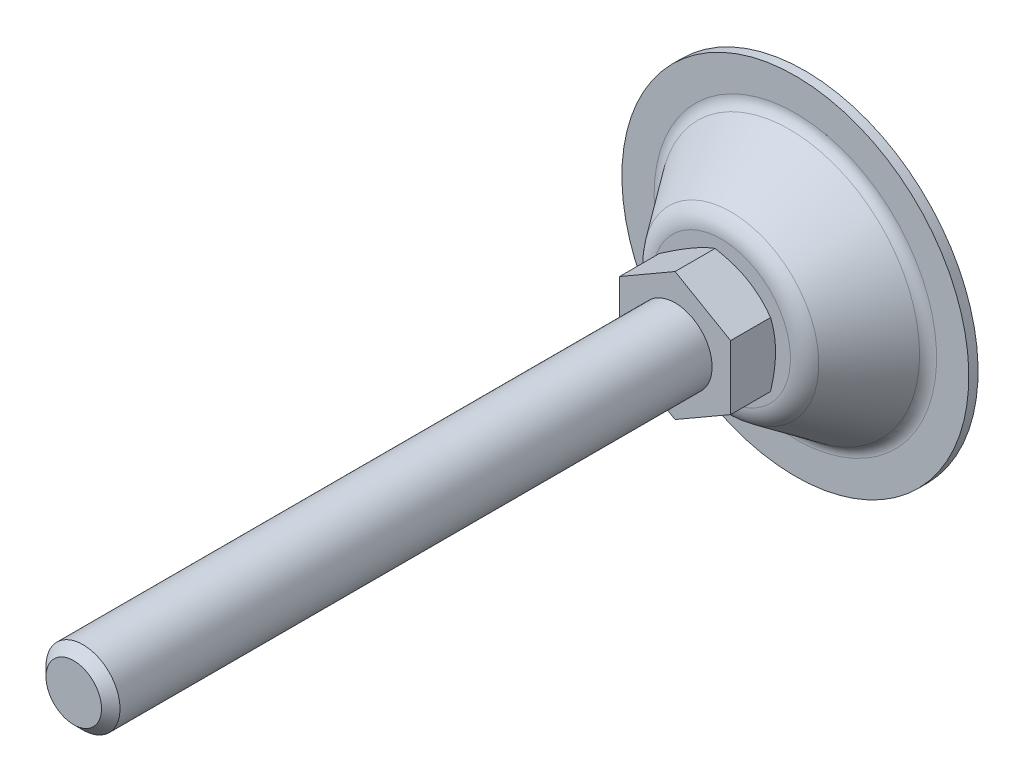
ISO-10303-21;
HEADER;
FILE_DESCRIPTION(('STEP AP214'),'2;1');
FILE_NAME('part.step','',(''),(''),'','','');
FILE_SCHEMA(('AUTOMOTIVE_DESIGN { 1 0 10303 214 1 1 1 1 }'));
ENDSEC;
DATA;
#1=APPLICATION_CONTEXT('core data for automotive mechanical design processes');
#2=APPLICATION_PROTOCOL_DEFINITION('international standard','automotive_design',2000,#1);
#3=PRODUCT_CONTEXT('',#1,'mechanical');
#4=PRODUCT('Part','Part','',(#3));
#5=PRODUCT_RELATED_PRODUCT_CATEGORY('part','',(#4));
#6=PRODUCT_DEFINITION_FORMATION('','',#4);
#7=PRODUCT_DEFINITION_CONTEXT('part definition',#1,'design');
#8=PRODUCT_DEFINITION('design','',#6,#7);
#9=PRODUCT_DEFINITION_SHAPE('','',#8);
#10=(LENGTH_UNIT() NAMED_UNIT(*) SI_UNIT(.MILLI.,.METRE.));
#11=(NAMED_UNIT(*) PLANE_ANGLE_UNIT() SI_UNIT($,.RADIAN.));
#12=(NAMED_UNIT(*) SI_UNIT($,.STERADIAN.) SOLID_ANGLE_UNIT());
#13=UNCERTAINTY_MEASURE_WITH_UNIT(LENGTH_MEASURE(1.E-05),#10,'distance_accuracy_value','');
#14=(GEOMETRIC_REPRESENTATION_CONTEXT(3) GLOBAL_UNCERTAINTY_ASSIGNED_CONTEXT((#13)) GLOBAL_UNIT_ASSIGNED_CONTEXT((#10,
#11,#12)) REPRESENTATION_CONTEXT('',''));
#15=CARTESIAN_POINT('',(0.,0.,0.));
#16=DIRECTION('',(0.,0.,1.));
#17=DIRECTION('',(1.,0.,0.));
#18=AXIS2_PLACEMENT_3D('',#15,#16,#17);
#19=CARTESIAN_POINT('',(0.,0.,28.));
#20=DIRECTION('',(0.,0.,1.));
#21=DIRECTION('',(0.5,-0.866025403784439,0.));
#22=AXIS2_PLACEMENT_3D('',#19,#20,#21);
#23=PLANE('',#22);
#24=DIRECTION('',(0.,1.,0.));
#25=VECTOR('',#24,1.);
#26=CARTESIAN_POINT('',(12.,-6.92820323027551,28.));
#27=LINE('',#26,#25);
#28=CARTESIAN_POINT('',(12.,-6.92820323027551,28.));
#29=VERTEX_POINT('',#28);
#30=CARTESIAN_POINT('',(12.,6.9282032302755,28.));
#31=VERTEX_POINT('',#30);
#32=EDGE_CURVE('E220',#29,#31,#27,.T.);
#33=ORIENTED_EDGE('',*,*,#32,.T.);
#34=DIRECTION('',(-0.866025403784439,0.5,0.));
#35=VECTOR('',#34,1.);
#36=CARTESIAN_POINT('',(12.,6.9282032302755,28.));
#37=LINE('',#36,#35);
#38=CARTESIAN_POINT('',(0.,13.856406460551,28.));
#39=VERTEX_POINT('',#38);
#40=EDGE_CURVE('E361',#31,#39,#37,.T.);
#41=ORIENTED_EDGE('',*,*,#40,.T.);
#42=DIRECTION('',(-0.866025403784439,-0.5,0.));
#43=VECTOR('',#42,1.);
#44=CARTESIAN_POINT('',(0.,13.856406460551,28.));
#45=LINE('',#44,#43);
#46=CARTESIAN_POINT('',(-12.,6.92820323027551,28.));
#47=VERTEX_POINT('',#46);
#48=EDGE_CURVE('E360',#39,#47,#45,.T.);
#49=ORIENTED_EDGE('',*,*,#48,.T.);
#50=DIRECTION('',(0.,-1.,0.));
#51=VECTOR('',#50,1.);
#52=CARTESIAN_POINT('',(-12.,6.92820323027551,28.));
#53=LINE('',#52,#51);
#54=CARTESIAN_POINT('',(-12.,-6.9282032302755,28.));
#55=VERTEX_POINT('',#54);
#56=EDGE_CURVE('E365',#47,#55,#53,.T.);
#57=ORIENTED_EDGE('',*,*,#56,.T.);
#58=DIRECTION('',(0.866025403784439,-0.5,0.));
#59=VECTOR('',#58,1.);
#60=CARTESIAN_POINT('',(-12.,-6.9282032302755,28.));
#61=LINE('',#60,#59);
#62=CARTESIAN_POINT('',(0.,-13.856406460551,28.));
#63=VERTEX_POINT('',#62);
#64=EDGE_CURVE('E367',#55,#63,#61,.T.);
#65=ORIENTED_EDGE('',*,*,#64,.T.);
#66=DIRECTION('',(0.866025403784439,0.5,0.));
#67=VECTOR('',#66,1.);
#68=CARTESIAN_POINT('',(0.,-13.856406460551,28.));
#69=LINE('',#68,#67);
#70=EDGE_CURVE('E37',#63,#29,#69,.T.);
#71=ORIENTED_EDGE('',*,*,#70,.T.);
#72=EDGE_LOOP('',(#33,#41,#49,#57,#65,#71));
#73=FACE_BOUND('',#72,.T.);
#74=CARTESIAN_POINT('',(0.,0.,28.));
#75=DIRECTION('',(0.,0.,1.));
#76=DIRECTION('',(0.5,-0.866025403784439,0.));
#77=AXIS2_PLACEMENT_3D('',#74,#75,#76);
#78=CIRCLE('',#77,8.);
#79=CARTESIAN_POINT('',(4.,-6.92820323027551,28.));
#80=VERTEX_POINT('',#79);
#81=EDGE_CURVE('E224',#80,#80,#78,.T.);
#82=ORIENTED_EDGE('',*,*,#81,.F.);
#83=EDGE_LOOP('',(#82));
#84=FACE_BOUND('',#83,.T.);
#85=ADVANCED_FACE('F14',(#73,#84),#23,.T.);
#86=CARTESIAN_POINT('',(-7.46811554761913,12.9351555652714,18.));
#87=DIRECTION('',(0.,0.,-1.));
#88=DIRECTION('',(-0.5,0.866025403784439,0.));
#89=AXIS2_PLACEMENT_3D('',#86,#87,#88);
#90=PLANE('',#89);
#91=CARTESIAN_POINT('',(-1.37317446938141E-13,2.37840794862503E-13,18.));
#92=DIRECTION('',(0.,0.,1.));
#93=DIRECTION('',(0.5,-0.866025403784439,0.));
#94=AXIS2_PLACEMENT_3D('',#91,#92,#93);
#95=CIRCLE('',#94,14.936231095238);
#96=CARTESIAN_POINT('',(7.46811554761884,-12.9351555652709,18.));
#97=VERTEX_POINT('',#96);
#98=EDGE_CURVE('E111',#97,#97,#95,.T.);
#99=ORIENTED_EDGE('',*,*,#98,.T.);
#100=EDGE_LOOP('',(#99));
#101=FACE_BOUND('',#100,.T.);
#102=CARTESIAN_POINT('',(0.,0.,18.));
#103=DIRECTION('',(0.,0.,-1.));
#104=DIRECTION('',(-0.5,0.866025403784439,0.));
#105=AXIS2_PLACEMENT_3D('',#102,#103,#104);
#106=CIRCLE('',#105,11.5);
#107=CARTESIAN_POINT('',(-5.75,9.95929214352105,18.));
#108=VERTEX_POINT('',#107);
#109=EDGE_CURVE('E84',#108,#108,#106,.T.);
#110=ORIENTED_EDGE('',*,*,#109,.T.);
#111=EDGE_LOOP('',(#110));
#112=FACE_BOUND('',#111,.T.);
#113=ADVANCED_FACE('F195',(#101,#112),#90,.F.);
#114=CARTESIAN_POINT('',(-1.54390389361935E-13,2.67411998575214E-13,4.9999999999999));
#115=DIRECTION('',(0.,0.,1.));
#116=DIRECTION('',(0.5,-0.866025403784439,0.));
#117=AXIS2_PLACEMENT_3D('',#114,#115,#116);
#118=TOROIDAL_SURFACE('',#117,30.5382613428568,3.);
#119=CARTESIAN_POINT('',(-1.55741344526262E-13,2.69751921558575E-13,3.24909185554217));
#120=DIRECTION('',(0.,0.,1.));
#121=DIRECTION('',(0.5,-0.866025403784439,0.));
#122=AXIS2_PLACEMENT_3D('',#119,#120,#121);
#123=CIRCLE('',#122,28.1022152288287);
#124=CARTESIAN_POINT('',(14.0511076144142,-24.3372322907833,3.2490918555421));
#125=VERTEX_POINT('',#124);
#126=EDGE_CURVE('E73',#125,#125,#123,.T.);
#127=ORIENTED_EDGE('',*,*,#126,.F.);
#128=EDGE_LOOP('',(#127));
#129=FACE_BOUND('',#128,.T.);
#130=CARTESIAN_POINT('',(-1.57301461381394E-13,2.72454123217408E-13,1.99999999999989));
#131=DIRECTION('',(0.,0.,1.));
#132=DIRECTION('',(0.5,-0.866025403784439,0.));
#133=AXIS2_PLACEMENT_3D('',#130,#131,#132);
#134=CIRCLE('',#133,30.5382613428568);
#135=CARTESIAN_POINT('',(15.2691306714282,-26.446910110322,1.99999999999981));
#136=VERTEX_POINT('',#135);
#137=EDGE_CURVE('E102',#136,#136,#134,.T.);
#138=ORIENTED_EDGE('',*,*,#137,.T.);
#139=EDGE_LOOP('',(#138));
#140=FACE_BOUND('',#139,.T.);
#141=ADVANCED_FACE('F198',(#129,#140),#118,.F.);
#142=CARTESIAN_POINT('',(-1.55741344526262E-13,2.69751921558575E-13,3.24909185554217));
#143=DIRECTION('',(0.,0.,-1.));
#144=DIRECTION('',(-0.5,0.866025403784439,0.));
#145=AXIS2_PLACEMENT_3D('',#142,#143,#144);
#146=CONICAL_SURFACE('',#145,28.1022152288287,0.623199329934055);
#147=CARTESIAN_POINT('',(-1.39917641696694E-13,2.42344464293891E-13,15.9181802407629));
#148=DIRECTION('',(0.,0.,1.));
#149=DIRECTION('',(0.5,-0.866025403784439,0.));
#150=AXIS2_PLACEMENT_3D('',#147,#148,#149);
#151=CIRCLE('',#150,18.9963079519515);
#152=CARTESIAN_POINT('',(9.49815397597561,-16.4512852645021,15.9181802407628));
#153=VERTEX_POINT('',#152);
#154=EDGE_CURVE('E114',#153,#153,#151,.T.);
#155=ORIENTED_EDGE('',*,*,#154,.F.);
#156=EDGE_LOOP('',(#155));
#157=FACE_BOUND('',#156,.T.);
#158=ORIENTED_EDGE('',*,*,#126,.T.);
#159=EDGE_LOOP('',(#158));
#160=FACE_BOUND('',#159,.T.);
#161=ADVANCED_FACE('F202',(#157,#160),#146,.T.);
#162=CARTESIAN_POINT('',(-1.43982048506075E-13,2.49384223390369E-13,13.));
#163=DIRECTION('',(0.,0.,1.));
#164=DIRECTION('',(0.5,-0.866025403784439,0.));
#165=AXIS2_PLACEMENT_3D('',#162,#163,#164);
#166=TOROIDAL_SURFACE('',#165,14.9362310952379,5.);
#167=ORIENTED_EDGE('',*,*,#98,.F.);
#168=EDGE_LOOP('',(#167));
#169=FACE_BOUND('',#168,.T.);
#170=ORIENTED_EDGE('',*,*,#154,.T.);
#171=EDGE_LOOP('',(#170));
#172=FACE_BOUND('',#171,.T.);
#173=ADVANCED_FACE('F193',(#169,#172),#166,.T.);
#174=CARTESIAN_POINT('',(-18.75,32.4759526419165,0.));
#175=DIRECTION('',(0.,0.,1.));
#176=DIRECTION('',(0.5,-0.866025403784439,0.));
#177=AXIS2_PLACEMENT_3D('',#174,#175,#176);
#178=PLANE('',#177);
#179=CARTESIAN_POINT('',(-1.59799463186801E-13,2.76780789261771E-13,-1.38777878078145E-13));
#180=DIRECTION('',(0.,0.,1.));
#181=DIRECTION('',(0.5,-0.866025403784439,0.));
#182=AXIS2_PLACEMENT_3D('',#179,#180,#181);
#183=CIRCLE('',#182,37.5);
#184=CARTESIAN_POINT('',(18.7499999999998,-32.4759526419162,-2.32452945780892E-13));
#185=VERTEX_POINT('',#184);
#186=EDGE_CURVE('E108',#185,#185,#183,.T.);
#187=ORIENTED_EDGE('',*,*,#186,.F.);
#188=EDGE_LOOP('',(#187));
#189=FACE_BOUND('',#188,.T.);
#190=ADVANCED_FACE('F189',(#189),#178,.F.);
#191=CARTESIAN_POINT('',(0.,0.,129.670029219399));
#192=DIRECTION('',(0.,0.,1.));
#193=DIRECTION('',(0.5,-0.866025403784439,0.));
#194=AXIS2_PLACEMENT_3D('',#191,#192,#193);
#195=CYLINDRICAL_SURFACE('',#194,37.5);
#196=CARTESIAN_POINT('',(-1.57301461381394E-13,2.72454123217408E-13,1.99999999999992));
#197=DIRECTION('',(0.,0.,1.));
#198=DIRECTION('',(0.5,-0.866025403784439,0.));
#199=AXIS2_PLACEMENT_3D('',#196,#197,#198);
#200=CIRCLE('',#199,37.5);
#201=CARTESIAN_POINT('',(18.7499999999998,-32.4759526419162,1.99999999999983));
#202=VERTEX_POINT('',#201);
#203=EDGE_CURVE('E105',#202,#202,#200,.T.);
#204=ORIENTED_EDGE('',*,*,#203,.F.);
#205=EDGE_LOOP('',(#204));
#206=FACE_BOUND('',#205,.T.);
#207=ORIENTED_EDGE('',*,*,#186,.T.);
#208=EDGE_LOOP('',(#207));
#209=FACE_BOUND('',#208,.T.);
#210=ADVANCED_FACE('F185',(#206,#209),#195,.T.);
#211=CARTESIAN_POINT('',(-18.75,32.4759526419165,2.));
#212=DIRECTION('',(0.,0.,-1.));
#213=DIRECTION('',(-0.5,0.866025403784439,0.));
#214=AXIS2_PLACEMENT_3D('',#211,#212,#213);
#215=PLANE('',#214);
#216=ORIENTED_EDGE('',*,*,#137,.F.);
#217=EDGE_LOOP('',(#216));
#218=FACE_BOUND('',#217,.T.);
#219=ORIENTED_EDGE('',*,*,#203,.T.);
#220=EDGE_LOOP('',(#219));
#221=FACE_BOUND('',#220,.T.);
#222=ADVANCED_FACE('F130',(#218,#221),#215,.F.);
#223=CARTESIAN_POINT('',(0.,0.,23.6283876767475));
#224=DIRECTION('',(0.,0.,1.));
#225=DIRECTION('',(0.5,-0.866025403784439,0.));
#226=AXIS2_PLACEMENT_3D('',#223,#224,#225);
#227=CONICAL_SURFACE('',#226,21.2486534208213,1.0471975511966);
#228=ORIENTED_EDGE('',*,*,#109,.F.);
#229=EDGE_LOOP('',(#228));
#230=FACE_BOUND('',#229,.T.);
#231=CARTESIAN_POINT('',(-10.0532557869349,-19.6606563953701,24.1094504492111));
#232=CARTESIAN_POINT('',(-9.82653838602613,-19.5297610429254,23.9825738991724));
#233=CARTESIAN_POINT('',(-9.59955317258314,-19.398711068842,23.856335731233));
#234=CARTESIAN_POINT('',(-9.14499119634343,-19.1362695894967,23.6052809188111));
#235=CARTESIAN_POINT('',(-8.91741442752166,-19.0048780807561,23.4804642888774));
#236=CARTESIAN_POINT('',(-8.23365135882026,-18.6101072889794,23.1083304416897));
#237=CARTESIAN_POINT('',(-7.77650041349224,-18.346171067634,22.8633674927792));
#238=CARTESIAN_POINT('',(-6.85659953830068,-17.8150660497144,22.3798814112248));
#239=CARTESIAN_POINT('',(-6.39383263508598,-17.5478874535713,22.1414012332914));
#240=CARTESIAN_POINT('',(-5.46459534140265,-17.0113920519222,21.6742979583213));
#241=CARTESIAN_POINT('',(-4.9981251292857,-16.7420753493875,21.4456743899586));
#242=CARTESIAN_POINT('',(-4.04609504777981,-16.1924205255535,20.9939474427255));
#243=CARTESIAN_POINT('',(-3.56039382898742,-15.912000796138,20.7712391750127));
#244=CARTESIAN_POINT('',(-2.58328268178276,-15.3478654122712,20.3428555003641));
#245=CARTESIAN_POINT('',(-2.09187211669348,-15.0641493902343,20.137182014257));
#246=CARTESIAN_POINT('',(-1.10351639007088,-14.4935219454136,19.7483225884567));
#247=CARTESIAN_POINT('',(-0.606584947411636,-14.2066184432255,19.565090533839));
#248=CARTESIAN_POINT('',(0.394451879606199,-13.628669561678,19.2270309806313));
#249=CARTESIAN_POINT('',(0.898554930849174,-13.3376255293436,19.072194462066));
#250=CARTESIAN_POINT('',(1.65882416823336,-12.8986838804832,18.8672836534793));
#251=CARTESIAN_POINT('',(1.91226998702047,-12.7523568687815,18.8036673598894));
#252=CARTESIAN_POINT('',(2.42088138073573,-12.4587099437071,18.6863216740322));
#253=CARTESIAN_POINT('',(2.6760469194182,-12.3113900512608,18.6325920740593));
#254=CARTESIAN_POINT('',(3.18791661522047,-12.0158619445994,18.5359727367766));
#255=CARTESIAN_POINT('',(3.44462075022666,-11.8676537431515,18.4930828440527));
#256=CARTESIAN_POINT('',(3.95929088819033,-11.5705088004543,18.4190010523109));
#257=CARTESIAN_POINT('',(4.2172568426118,-11.4215720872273,18.3878087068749));
#258=CARTESIAN_POINT('',(4.73074751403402,-11.1251081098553,18.3381289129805));
#259=CARTESIAN_POINT('',(4.98626060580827,-10.977587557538,18.319482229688));
#260=CARTESIAN_POINT('',(5.49773994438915,-10.6822848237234,18.294677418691));
#261=CARTESIAN_POINT('',(5.75370618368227,-10.534502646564,18.2885190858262));
#262=CARTESIAN_POINT('',(6.26563805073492,-10.2389386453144,18.2888371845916));
#263=CARTESIAN_POINT('',(6.5216036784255,-10.091156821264,18.295313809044));
#264=CARTESIAN_POINT('',(7.03307268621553,-9.79586005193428,18.3207453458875));
#265=CARTESIAN_POINT('',(7.28857604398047,-9.64834511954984,18.3397008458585));
#266=CARTESIAN_POINT('',(7.90442793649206,-9.29278286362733,18.4000305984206));
#267=CARTESIAN_POINT('',(8.26434066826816,-9.08498715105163,18.4474404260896));
#268=CARTESIAN_POINT('',(8.98145632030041,-8.67096023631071,18.5644233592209));
#269=CARTESIAN_POINT('',(9.33865885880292,-8.46472925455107,18.6339995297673));
#270=CARTESIAN_POINT('',(10.0500214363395,-8.0540238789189,18.7928402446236));
#271=CARTESIAN_POINT('',(10.4041788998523,-7.84955097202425,18.8821200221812));
#272=CARTESIAN_POINT('',(11.1089234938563,-7.44266649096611,19.077650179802));
#273=CARTESIAN_POINT('',(11.4595106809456,-7.24025488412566,19.1839002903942));
#274=CARTESIAN_POINT('',(12.1650627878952,-6.83290418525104,19.4133803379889));
#275=CARTESIAN_POINT('',(12.5199465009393,-6.62801197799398,19.5369408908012));
#276=CARTESIAN_POINT('',(13.2262157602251,-6.22024723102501,19.7966751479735));
#277=CARTESIAN_POINT('',(13.5776012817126,-6.01737470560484,19.9328489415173));
#278=CARTESIAN_POINT('',(14.2770536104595,-5.61354571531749,20.2156602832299));
#279=CARTESIAN_POINT('',(14.6251214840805,-5.41258863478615,20.3622943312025));
#280=CARTESIAN_POINT('',(15.318378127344,-5.01233672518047,20.664315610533));
#281=CARTESIAN_POINT('',(15.6635669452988,-4.81304186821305,20.8197026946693));
#282=CARTESIAN_POINT('',(16.5374507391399,-4.30850482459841,21.2238005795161));
#283=CARTESIAN_POINT('',(17.0644049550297,-4.00426766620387,21.477525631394));
#284=CARTESIAN_POINT('',(18.1134107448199,-3.39862389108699,21.9981888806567));
#285=CARTESIAN_POINT('',(18.635461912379,-3.097217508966,22.2651281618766));
#286=CARTESIAN_POINT('',(19.6756923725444,-2.49664017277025,22.8093074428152));
#287=CARTESIAN_POINT('',(20.1938705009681,-2.19746989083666,23.0865504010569));
#288=CARTESIAN_POINT('',(21.226926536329,-1.60103471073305,23.6490491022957));
#289=CARTESIAN_POINT('',(21.7418045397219,-1.30376975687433,23.9343046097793));
#290=CARTESIAN_POINT('',(22.7695382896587,-0.710407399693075,24.5115723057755));
#291=CARTESIAN_POINT('',(23.2823905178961,-0.414312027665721,24.8035928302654));
#292=CARTESIAN_POINT('',(24.3058697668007,0.176593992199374,25.3927886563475));
#293=CARTESIAN_POINT('',(24.8164967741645,0.471404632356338,25.689963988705));
#294=CARTESIAN_POINT('',(25.835813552,1.05990744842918,26.2884658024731));
#295=CARTESIAN_POINT('',(26.3445036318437,1.35359980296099,26.5897915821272));
#296=CARTESIAN_POINT('',(27.3603325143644,1.94008888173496,27.1959115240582));
#297=CARTESIAN_POINT('',(27.8674713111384,2.23288560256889,27.5007056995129));
#298=CARTESIAN_POINT('',(29.2909254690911,3.05471724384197,28.3613531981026));
#299=CARTESIAN_POINT('',(30.2057559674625,3.58289487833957,28.9204806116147));
#300=CARTESIAN_POINT('',(32.0322611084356,4.63742811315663,30.0456673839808));
#301=CARTESIAN_POINT('',(32.9439356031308,5.16378362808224,30.6117270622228));
#302=CARTESIAN_POINT('',(34.7622656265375,6.2135969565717,31.7474746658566));
#303=CARTESIAN_POINT('',(35.6689280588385,6.73705875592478,32.3171478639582));
#304=CARTESIAN_POINT('',(37.0274616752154,7.52140850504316,33.174659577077));
#305=CARTESIAN_POINT('',(37.4800486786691,7.78270973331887,33.4609880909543));
#306=CARTESIAN_POINT('',(38.3847950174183,8.30506527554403,34.0345430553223));
#307=CARTESIAN_POINT('',(38.8369543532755,8.5661195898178,34.3217695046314));
#308=CARTESIAN_POINT('',(39.2889251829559,8.82706506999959,34.6093910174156));
#309=B_SPLINE_CURVE_WITH_KNOTS('',3,(#231,#232,#233,#234,#235,#236,#237,#238,#239,#240,#241,
#242,#243,#244,#245,#246,#247,#248,#249,#250,#251,#252,#253,#254,#255,#256,#257,#258,#259,#260,
#261,#262,#263,#264,#265,#266,#267,#268,#269,#270,#271,#272,#273,#274,#275,#276,#277,#278,#279,
#280,#281,#282,#283,#284,#285,#286,#287,#288,#289,#290,#291,#292,#293,#294,#295,#296,#297,#298,
#299,#300,#301,#302,#303,#304,#305,#306,#307,#308),.UNSPECIFIED.,.F.,.F.,(4,2,2,2,2,2,2,2,2,2,2,
2,2,2,2,2,2,2,2,2,2,2,2,2,2,2,2,2,2,2,2,2,2,2,2,2,2,2,4),(0.,0.872745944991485,1.74550081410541,
3.49127289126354,5.24667070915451,7.00198449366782,8.81209333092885,10.6224059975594,
12.4289339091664,14.2348869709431,15.1332127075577,16.0315195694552,16.929813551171,
17.8280732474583,18.7147052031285,19.6013225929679,20.4879535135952,21.3746261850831,
22.6287917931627,23.88313089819,25.1384431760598,26.3937355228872,27.6775150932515,
28.9613037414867,30.2446648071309,31.5280042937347,33.5055452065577,35.4832485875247,
37.4615242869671,39.439741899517,41.4205425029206,43.4013549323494,45.3818364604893,
47.3623255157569,50.9478944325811,54.5336291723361,58.1092552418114,59.8969559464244,
61.6846542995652),.UNSPECIFIED.);
#310=CARTESIAN_POINT('',(0.,-13.856406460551,19.3604719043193));
#311=VERTEX_POINT('',#310);
#312=CARTESIAN_POINT('',(12.,-6.92820323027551,19.3604719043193));
#313=VERTEX_POINT('',#312);
#314=EDGE_CURVE('E65',#311,#313,#309,.T.);
#315=ORIENTED_EDGE('',*,*,#314,.F.);
#316=CARTESIAN_POINT('',(-12.0002,-6.92808776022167,19.3605385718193));
#317=CARTESIAN_POINT('',(-11.7364142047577,-7.08038456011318,19.2726247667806));
#318=CARTESIAN_POINT('',(-11.4716448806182,-7.2332492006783,19.1887011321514));
#319=CARTESIAN_POINT('',(-10.9399829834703,-7.54020434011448,19.0299413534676));
#320=CARTESIAN_POINT('',(-10.6730897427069,-7.69429522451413,18.9551081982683));
#321=CARTESIAN_POINT('',(-9.86810959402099,-8.15905073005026,18.7456926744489));
#322=CARTESIAN_POINT('',(-9.32684492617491,-8.47155003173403,18.6265783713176));
#323=CARTESIAN_POINT('',(-8.51686717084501,-8.93919090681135,18.4869061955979));
#324=CARTESIAN_POINT('',(-8.25057389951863,-9.09293539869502,18.4471189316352));
#325=CARTESIAN_POINT('',(-7.71675440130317,-9.40113622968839,18.3803985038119));
#326=CARTESIAN_POINT('',(-7.44922815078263,-9.55559258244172,18.3534655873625));
#327=CARTESIAN_POINT('',(-6.91372963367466,-9.86476279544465,18.3131437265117));
#328=CARTESIAN_POINT('',(-6.64575827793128,-10.0194761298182,18.2997386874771));
#329=CARTESIAN_POINT('',(-6.10956726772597,-10.3290461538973,18.2867582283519));
#330=CARTESIAN_POINT('',(-5.84134762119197,-10.4839028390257,18.2871823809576));
#331=CARTESIAN_POINT('',(-5.3399106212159,-10.7734076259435,18.3008951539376));
#332=CARTESIAN_POINT('',(-5.10665750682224,-10.908076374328,18.3125111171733));
#333=CARTESIAN_POINT('',(-4.64068775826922,-11.1771041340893,18.3459831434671));
#334=CARTESIAN_POINT('',(-4.40797116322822,-11.3114631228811,18.367839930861));
#335=CARTESIAN_POINT('',(-3.94320092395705,-11.5797983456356,18.4214125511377));
#336=CARTESIAN_POINT('',(-3.71114798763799,-11.7137741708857,18.4531365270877));
#337=CARTESIAN_POINT('',(-3.24813003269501,-11.9810977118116,18.5258869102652));
#338=CARTESIAN_POINT('',(-3.01716508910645,-12.1144453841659,18.566913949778));
#339=CARTESIAN_POINT('',(-2.31605804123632,-12.5192297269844,18.7049867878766));
#340=CARTESIAN_POINT('',(-1.84794625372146,-12.789494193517,18.8158000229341));
#341=CARTESIAN_POINT('',(-0.918702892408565,-13.3259930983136,19.0673009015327));
#342=CARTESIAN_POINT('',(-0.457559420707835,-13.5922344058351,19.2079294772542));
#343=CARTESIAN_POINT('',(0.000199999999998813,-13.8565219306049,19.3605385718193));
#344=B_SPLINE_CURVE_WITH_KNOTS('',3,(#316,#317,#318,#319,#320,#321,#322,#323,#324,#325,#326,
#327,#328,#329,#330,#331,#332,#333,#334,#335,#336,#337,#338,#339,#340,#341,#342,#343),
.UNSPECIFIED.,.F.,.F.,(4,2,2,2,2,2,2,2,2,2,2,2,2,4),(0.,0.951004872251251,1.90232158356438,
3.80900466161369,4.73894551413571,5.6689042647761,6.59775529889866,7.52657763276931,
8.3351464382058,9.14377244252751,9.95306755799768,10.7624176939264,12.4167102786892,
14.0677556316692),.UNSPECIFIED.);
#345=CARTESIAN_POINT('',(-12.,-6.9282032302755,19.3604719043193));
#346=VERTEX_POINT('',#345);
#347=EDGE_CURVE('E68',#346,#311,#344,.T.);
#348=ORIENTED_EDGE('',*,*,#347,.F.);
#349=CARTESIAN_POINT('',(-12.,6.92843417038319,19.3605385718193));
#350=CARTESIAN_POINT('',(-12.,6.62384057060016,19.2726247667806));
#351=CARTESIAN_POINT('',(-12.,6.31811128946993,19.1887011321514));
#352=CARTESIAN_POINT('',(-12.,5.70420101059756,19.0299413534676));
#353=CARTESIAN_POINT('',(-12.,5.39601924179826,18.9551081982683));
#354=CARTESIAN_POINT('',(-12.,4.466508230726,18.7456926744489));
#355=CARTESIAN_POINT('',(-12.,3.84150962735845,18.6265783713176));
#356=CARTESIAN_POINT('',(-12.,2.9062278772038,18.4869061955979));
#357=CARTESIAN_POINT('',(-12.,2.59873889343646,18.4471189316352));
#358=CARTESIAN_POINT('',(-12.,1.98233723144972,18.3803985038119));
#359=CARTESIAN_POINT('',(-12.,1.67342452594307,18.3534655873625));
#360=CARTESIAN_POINT('',(-12.,1.05508409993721,18.3131437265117));
#361=CARTESIAN_POINT('',(-12.,0.745657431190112,18.2997386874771));
#362=CARTESIAN_POINT('',(-12.,0.126517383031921,18.2867582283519));
#363=CARTESIAN_POINT('',(-12.,-0.183195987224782,18.2871823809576));
#364=CARTESIAN_POINT('',(-12.,-0.762205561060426,18.3008951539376));
#365=CARTESIAN_POINT('',(-12.,-1.03154305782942,18.3125111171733));
#366=CARTESIAN_POINT('',(-12.,-1.56959857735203,18.3459831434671));
#367=CARTESIAN_POINT('',(-12.,-1.83831655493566,18.367839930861));
#368=CARTESIAN_POINT('',(-12.,-2.37498700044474,18.4214125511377));
#369=CARTESIAN_POINT('',(-12.,-2.64293865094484,18.4531365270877));
#370=CARTESIAN_POINT('',(-12.,-3.17758573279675,18.5258869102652));
#371=CARTESIAN_POINT('',(-12.,-3.4442810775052,18.566913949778));
#372=CARTESIAN_POINT('',(-12.,-4.25384976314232,18.7049867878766));
#373=CARTESIAN_POINT('',(-12.,-4.79437869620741,18.8158000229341));
#374=CARTESIAN_POINT('',(-12.,-5.86737650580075,19.0673009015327));
#375=CARTESIAN_POINT('',(-12.,-6.39985912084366,19.2079294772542));
#376=CARTESIAN_POINT('',(-12.,-6.92843417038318,19.3605385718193));
#377=B_SPLINE_CURVE_WITH_KNOTS('',3,(#349,#350,#351,#352,#353,#354,#355,#356,#357,#358,#359,
#360,#361,#362,#363,#364,#365,#366,#367,#368,#369,#370,#371,#372,#373,#374,#375,#376),
.UNSPECIFIED.,.F.,.F.,(4,2,2,2,2,2,2,2,2,2,2,2,2,4),(0.,0.951004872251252,1.90232158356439,
3.80900466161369,4.73894551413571,5.6689042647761,6.59775529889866,7.52657763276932,
8.3351464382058,9.14377244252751,9.95306755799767,10.7624176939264,12.4167102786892,
14.0677556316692),.UNSPECIFIED.);
#378=CARTESIAN_POINT('',(-12.,6.92820323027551,19.3604719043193));
#379=VERTEX_POINT('',#378);
#380=EDGE_CURVE('E83',#379,#346,#377,.T.);
#381=ORIENTED_EDGE('',*,*,#380,.F.);
#382=CARTESIAN_POINT('',(-22.0532557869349,1.12395329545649,24.1094504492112));
#383=CARTESIAN_POINT('',(-21.8265383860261,1.25484864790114,23.9825738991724));
#384=CARTESIAN_POINT('',(-21.5995531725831,1.38589862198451,23.856335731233));
#385=CARTESIAN_POINT('',(-21.1449911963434,1.64834010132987,23.6052809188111));
#386=CARTESIAN_POINT('',(-20.9174144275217,1.77973161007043,23.4804642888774));
#387=CARTESIAN_POINT('',(-20.2336513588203,2.1745024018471,23.1083304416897));
#388=CARTESIAN_POINT('',(-19.7765004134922,2.43843862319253,22.8633674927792));
#389=CARTESIAN_POINT('',(-18.8565995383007,2.96954364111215,22.3798814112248));
#390=CARTESIAN_POINT('',(-18.393832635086,3.23672223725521,22.1414012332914));
#391=CARTESIAN_POINT('',(-17.4645953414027,3.77321763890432,21.6742979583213));
#392=CARTESIAN_POINT('',(-16.9981251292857,4.04253434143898,21.4456743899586));
#393=CARTESIAN_POINT('',(-16.0460950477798,4.59218916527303,20.9939474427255));
#394=CARTESIAN_POINT('',(-15.5603938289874,4.87260889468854,20.7712391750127));
#395=CARTESIAN_POINT('',(-14.5832826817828,5.43674427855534,20.3428555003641));
#396=CARTESIAN_POINT('',(-14.0918721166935,5.72046030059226,20.137182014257));
#397=CARTESIAN_POINT('',(-13.1035163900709,6.29108774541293,19.7483225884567));
#398=CARTESIAN_POINT('',(-12.6065849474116,6.57799124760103,19.565090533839));
#399=CARTESIAN_POINT('',(-11.6055481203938,7.1559401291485,19.2270309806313));
#400=CARTESIAN_POINT('',(-11.1014450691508,7.44698416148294,19.072194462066));
#401=CARTESIAN_POINT('',(-10.3411758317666,7.8859258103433,18.8672836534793));
#402=CARTESIAN_POINT('',(-10.0877300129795,8.03225282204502,18.8036673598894));
#403=CARTESIAN_POINT('',(-9.57911861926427,8.32589974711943,18.6863216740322));
#404=CARTESIAN_POINT('',(-9.3239530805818,8.47321963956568,18.6325920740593));
#405=CARTESIAN_POINT('',(-8.81208338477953,8.76874774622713,18.5359727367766));
#406=CARTESIAN_POINT('',(-8.55537924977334,8.91695594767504,18.4930828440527));
#407=CARTESIAN_POINT('',(-8.04070911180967,9.21410089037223,18.4190010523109));
#408=CARTESIAN_POINT('',(-7.78274315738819,9.36303760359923,18.3878087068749));
#409=CARTESIAN_POINT('',(-7.26925248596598,9.6595015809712,18.3381289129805));
#410=CARTESIAN_POINT('',(-7.01373939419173,9.80702213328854,18.319482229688));
#411=CARTESIAN_POINT('',(-6.50226005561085,10.1023248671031,18.294677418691));
#412=CARTESIAN_POINT('',(-6.24629381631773,10.2501070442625,18.2885190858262));
#413=CARTESIAN_POINT('',(-5.73436194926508,10.5456710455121,18.2888371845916));
#414=CARTESIAN_POINT('',(-5.4783963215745,10.6934528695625,18.295313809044));
#415=CARTESIAN_POINT('',(-4.96692731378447,10.9887496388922,18.3207453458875));
#416=CARTESIAN_POINT('',(-4.71142395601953,11.1362645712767,18.3397008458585));
#417=CARTESIAN_POINT('',(-4.09557206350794,11.4918268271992,18.4000305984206));
#418=CARTESIAN_POINT('',(-3.73565933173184,11.6996225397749,18.4474404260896));
#419=CARTESIAN_POINT('',(-3.01854367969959,12.1136494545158,18.5644233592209));
#420=CARTESIAN_POINT('',(-2.66134114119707,12.3198804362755,18.6339995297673));
#421=CARTESIAN_POINT('',(-1.9499785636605,12.7305858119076,18.7928402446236));
#422=CARTESIAN_POINT('',(-1.59582110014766,12.9350587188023,18.8821200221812));
#423=CARTESIAN_POINT('',(-0.891076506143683,13.3419431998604,19.077650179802));
#424=CARTESIAN_POINT('',(-0.540489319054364,13.5443548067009,19.1839002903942));
#425=CARTESIAN_POINT('',(0.165062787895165,13.9517055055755,19.4133803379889));
#426=CARTESIAN_POINT('',(0.519946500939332,14.1565977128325,19.5369408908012));
#427=CARTESIAN_POINT('',(1.22621576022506,14.5643624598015,19.7966751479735));
#428=CARTESIAN_POINT('',(1.57760128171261,14.7672349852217,19.9328489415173));
#429=CARTESIAN_POINT('',(2.27705361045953,15.171063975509,20.2156602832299));
#430=CARTESIAN_POINT('',(2.62512148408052,15.3720210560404,20.3622943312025));
#431=CARTESIAN_POINT('',(3.31837812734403,15.7722729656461,20.664315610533));
#432=CARTESIAN_POINT('',(3.66356694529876,15.9715678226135,20.8197026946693));
#433=CARTESIAN_POINT('',(4.53745073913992,16.4761048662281,21.2238005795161));
#434=CARTESIAN_POINT('',(5.06440495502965,16.7803420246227,21.477525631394));
#435=CARTESIAN_POINT('',(6.1134107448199,17.3859857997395,21.9981888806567));
#436=CARTESIAN_POINT('',(6.63546191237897,17.6873921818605,22.2651281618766));
#437=CARTESIAN_POINT('',(7.67569237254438,18.2879695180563,22.8093074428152));
#438=CARTESIAN_POINT('',(8.19387050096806,18.5871397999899,23.0865504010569));
#439=CARTESIAN_POINT('',(9.22692653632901,19.1835749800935,23.6490491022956));
#440=CARTESIAN_POINT('',(9.74180453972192,19.4808399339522,23.9343046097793));
#441=CARTESIAN_POINT('',(10.7695382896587,20.0742022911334,24.5115723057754));
#442=CARTESIAN_POINT('',(11.2823905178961,20.3702976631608,24.8035928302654));
#443=CARTESIAN_POINT('',(12.3058697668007,20.9612036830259,25.3927886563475));
#444=CARTESIAN_POINT('',(12.8164967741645,21.2560143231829,25.689963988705));
#445=CARTESIAN_POINT('',(13.835813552,21.8445171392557,26.2884658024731));
#446=CARTESIAN_POINT('',(14.3445036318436,22.1382094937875,26.5897915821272));
#447=CARTESIAN_POINT('',(15.3603325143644,22.7246985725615,27.1959115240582));
#448=CARTESIAN_POINT('',(15.8674713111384,23.0174952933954,27.5007056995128));
#449=CARTESIAN_POINT('',(17.2909254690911,23.8393269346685,28.3613531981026));
#450=CARTESIAN_POINT('',(18.2057559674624,24.3675045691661,28.9204806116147));
#451=CARTESIAN_POINT('',(20.0322611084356,25.4220378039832,30.0456673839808));
#452=CARTESIAN_POINT('',(20.9439356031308,25.9483933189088,30.6117270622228));
#453=CARTESIAN_POINT('',(22.7622656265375,26.9982066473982,31.7474746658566));
#454=CARTESIAN_POINT('',(23.6689280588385,27.5216684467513,32.3171478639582));
#455=CARTESIAN_POINT('',(25.0274616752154,28.3060181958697,33.1746595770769));
#456=CARTESIAN_POINT('',(25.4800486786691,28.5673194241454,33.4609880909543));
#457=CARTESIAN_POINT('',(26.3847950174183,29.0896749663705,34.0345430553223));
#458=CARTESIAN_POINT('',(26.8369543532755,29.3507292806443,34.3217695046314));
#459=CARTESIAN_POINT('',(27.2889251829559,29.6116747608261,34.6093910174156));
#460=B_SPLINE_CURVE_WITH_KNOTS('',3,(#382,#383,#384,#385,#386,#387,#388,#389,#390,#391,#392,
#393,#394,#395,#396,#397,#398,#399,#400,#401,#402,#403,#404,#405,#406,#407,#408,#409,#410,#411,
#412,#413,#414,#415,#416,#417,#418,#419,#420,#421,#422,#423,#424,#425,#426,#427,#428,#429,#430,
#431,#432,#433,#434,#435,#436,#437,#438,#439,#440,#441,#442,#443,#444,#445,#446,#447,#448,#449,
#450,#451,#452,#453,#454,#455,#456,#457,#458,#459),.UNSPECIFIED.,.F.,.F.,(4,2,2,2,2,2,2,2,2,2,2,
2,2,2,2,2,2,2,2,2,2,2,2,2,2,2,2,2,2,2,2,2,2,2,2,2,2,2,4),(0.,0.872745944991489,1.74550081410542,
3.49127289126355,5.24667070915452,7.00198449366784,8.81209333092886,10.6224059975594,
12.4289339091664,14.2348869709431,15.1332127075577,16.0315195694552,16.9298135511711,
17.8280732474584,18.7147052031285,19.6013225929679,20.4879535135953,21.3746261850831,
22.6287917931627,23.88313089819,25.1384431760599,26.3937355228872,27.6775150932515,
28.9613037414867,30.244664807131,31.5280042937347,33.5055452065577,35.4832485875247,
37.4615242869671,39.439741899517,41.4205425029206,43.4013549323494,45.3818364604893,
47.3623255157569,50.9478944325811,54.5336291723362,58.1092552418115,59.8969559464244,
61.6846542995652),.UNSPECIFIED.);
#461=CARTESIAN_POINT('',(0.,13.856406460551,19.3604719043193));
#462=VERTEX_POINT('',#461);
#463=EDGE_CURVE('E152',#462,#379,#460,.F.);
#464=ORIENTED_EDGE('',*,*,#463,.F.);
#465=CARTESIAN_POINT('',(12.0002,6.92808776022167,19.3605385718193));
#466=CARTESIAN_POINT('',(11.7364142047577,7.08038456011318,19.2726247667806));
#467=CARTESIAN_POINT('',(11.4716448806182,7.2332492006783,19.1887011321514));
#468=CARTESIAN_POINT('',(10.9399829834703,7.54020434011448,19.0299413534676));
#469=CARTESIAN_POINT('',(10.6730897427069,7.69429522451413,18.9551081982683));
#470=CARTESIAN_POINT('',(9.86810959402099,8.15905073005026,18.7456926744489));
#471=CARTESIAN_POINT('',(9.32684492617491,8.47155003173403,18.6265783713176));
#472=CARTESIAN_POINT('',(8.51686717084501,8.93919090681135,18.4869061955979));
#473=CARTESIAN_POINT('',(8.25057389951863,9.09293539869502,18.4471189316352));
#474=CARTESIAN_POINT('',(7.71675440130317,9.40113622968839,18.3803985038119));
#475=CARTESIAN_POINT('',(7.44922815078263,9.55559258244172,18.3534655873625));
#476=CARTESIAN_POINT('',(6.91372963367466,9.86476279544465,18.3131437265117));
#477=CARTESIAN_POINT('',(6.64575827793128,10.0194761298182,18.2997386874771));
#478=CARTESIAN_POINT('',(6.10956726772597,10.3290461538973,18.2867582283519));
#479=CARTESIAN_POINT('',(5.84134762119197,10.4839028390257,18.2871823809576));
#480=CARTESIAN_POINT('',(5.3399106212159,10.7734076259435,18.3008951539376));
#481=CARTESIAN_POINT('',(5.10665750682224,10.908076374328,18.3125111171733));
#482=CARTESIAN_POINT('',(4.64068775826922,11.1771041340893,18.3459831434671));
#483=CARTESIAN_POINT('',(4.40797116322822,11.3114631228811,18.367839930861));
#484=CARTESIAN_POINT('',(3.94320092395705,11.5797983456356,18.4214125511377));
#485=CARTESIAN_POINT('',(3.71114798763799,11.7137741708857,18.4531365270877));
#486=CARTESIAN_POINT('',(3.24813003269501,11.9810977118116,18.5258869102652));
#487=CARTESIAN_POINT('',(3.01716508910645,12.1144453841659,18.566913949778));
#488=CARTESIAN_POINT('',(2.31605804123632,12.5192297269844,18.7049867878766));
#489=CARTESIAN_POINT('',(1.84794625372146,12.789494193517,18.8158000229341));
#490=CARTESIAN_POINT('',(0.918702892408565,13.3259930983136,19.0673009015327));
#491=CARTESIAN_POINT('',(0.457559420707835,13.5922344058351,19.2079294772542));
#492=CARTESIAN_POINT('',(-0.000199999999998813,13.8565219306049,19.3605385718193));
#493=B_SPLINE_CURVE_WITH_KNOTS('',3,(#465,#466,#467,#468,#469,#470,#471,#472,#473,#474,#475,
#476,#477,#478,#479,#480,#481,#482,#483,#484,#485,#486,#487,#488,#489,#490,#491,#492),
.UNSPECIFIED.,.F.,.F.,(4,2,2,2,2,2,2,2,2,2,2,2,2,4),(0.,0.951004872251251,1.90232158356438,
3.80900466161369,4.73894551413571,5.6689042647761,6.59775529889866,7.52657763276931,
8.3351464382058,9.14377244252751,9.95306755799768,10.7624176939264,12.4167102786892,
14.0677556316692),.UNSPECIFIED.);
#494=CARTESIAN_POINT('',(12.,6.9282032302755,19.3604719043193));
#495=VERTEX_POINT('',#494);
#496=EDGE_CURVE('E159',#495,#462,#493,.T.);
#497=ORIENTED_EDGE('',*,*,#496,.F.);
#498=CARTESIAN_POINT('',(12.,-6.92843417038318,19.3605385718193));
#499=CARTESIAN_POINT('',(12.,-6.62384057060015,19.2726247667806));
#500=CARTESIAN_POINT('',(12.,-6.31811128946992,19.1887011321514));
#501=CARTESIAN_POINT('',(12.,-5.70420101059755,19.0299413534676));
#502=CARTESIAN_POINT('',(12.,-5.39601924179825,18.9551081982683));
#503=CARTESIAN_POINT('',(12.,-4.46650823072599,18.7456926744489));
#504=CARTESIAN_POINT('',(12.,-3.84150962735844,18.6265783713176));
#505=CARTESIAN_POINT('',(12.,-2.9062278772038,18.4869061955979));
#506=CARTESIAN_POINT('',(12.,-2.59873889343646,18.4471189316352));
#507=CARTESIAN_POINT('',(12.,-1.98233723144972,18.3803985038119));
#508=CARTESIAN_POINT('',(12.,-1.67342452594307,18.3534655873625));
#509=CARTESIAN_POINT('',(12.,-1.05508409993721,18.3131437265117));
#510=CARTESIAN_POINT('',(12.,-0.745657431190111,18.2997386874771));
#511=CARTESIAN_POINT('',(12.,-0.12651738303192,18.2867582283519));
#512=CARTESIAN_POINT('',(12.,0.183195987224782,18.2871823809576));
#513=CARTESIAN_POINT('',(12.,0.762205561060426,18.3008951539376));
#514=CARTESIAN_POINT('',(12.,1.03154305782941,18.3125111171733));
#515=CARTESIAN_POINT('',(12.,1.56959857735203,18.3459831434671));
#516=CARTESIAN_POINT('',(12.,1.83831655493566,18.367839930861));
#517=CARTESIAN_POINT('',(12.,2.37498700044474,18.4214125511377));
#518=CARTESIAN_POINT('',(12.,2.64293865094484,18.4531365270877));
#519=CARTESIAN_POINT('',(12.,3.17758573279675,18.5258869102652));
#520=CARTESIAN_POINT('',(12.,3.4442810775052,18.566913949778));
#521=CARTESIAN_POINT('',(12.,4.25384976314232,18.7049867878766));
#522=CARTESIAN_POINT('',(12.,4.79437869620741,18.8158000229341));
#523=CARTESIAN_POINT('',(12.,5.86737650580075,19.0673009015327));
#524=CARTESIAN_POINT('',(12.,6.39985912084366,19.2079294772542));
#525=CARTESIAN_POINT('',(12.,6.92843417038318,19.3605385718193));
#526=B_SPLINE_CURVE_WITH_KNOTS('',3,(#498,#499,#500,#501,#502,#503,#504,#505,#506,#507,#508,
#509,#510,#511,#512,#513,#514,#515,#516,#517,#518,#519,#520,#521,#522,#523,#524,#525),
.UNSPECIFIED.,.F.,.F.,(4,2,2,2,2,2,2,2,2,2,2,2,2,4),(0.,0.951004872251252,1.90232158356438,
3.80900466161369,4.7389455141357,5.66890426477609,6.59775529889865,7.52657763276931,
8.33514643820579,9.1437724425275,9.95306755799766,10.7624176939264,12.4167102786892,
14.0677556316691),.UNSPECIFIED.);
#527=EDGE_CURVE('E29',#313,#495,#526,.T.);
#528=ORIENTED_EDGE('',*,*,#527,.F.);
#529=EDGE_LOOP('',(#315,#348,#381,#464,#497,#528));
#530=FACE_BOUND('',#529,.T.);
#531=ADVANCED_FACE('F67',(#230,#530),#227,.T.);
#532=CARTESIAN_POINT('',(0.,-13.856406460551,28.));
#533=DIRECTION('',(-0.5,0.866025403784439,0.));
#534=DIRECTION('',(0.,0.,1.));
#535=AXIS2_PLACEMENT_3D('',#532,#533,#534);
#536=PLANE('',#535);
#537=DIRECTION('',(0.,0.,-1.));
#538=VECTOR('',#537,1.);
#539=CARTESIAN_POINT('',(0.,-13.856406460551,28.));
#540=LINE('',#539,#538);
#541=EDGE_CURVE('E80',#63,#311,#540,.T.);
#542=ORIENTED_EDGE('',*,*,#541,.T.);
#543=ORIENTED_EDGE('',*,*,#314,.T.);
#544=DIRECTION('',(0.,0.,-1.));
#545=VECTOR('',#544,1.);
#546=CARTESIAN_POINT('',(12.,-6.92820323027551,28.));
#547=LINE('',#546,#545);
#548=EDGE_CURVE('E87',#29,#313,#547,.T.);
#549=ORIENTED_EDGE('',*,*,#548,.F.);
#550=ORIENTED_EDGE('',*,*,#70,.F.);
#551=EDGE_LOOP('',(#542,#543,#549,#550));
#552=FACE_BOUND('',#551,.T.);
#553=ADVANCED_FACE('F86',(#552),#536,.F.);
#554=CARTESIAN_POINT('',(-12.,-6.9282032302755,28.));
#555=DIRECTION('',(0.5,0.866025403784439,0.));
#556=DIRECTION('',(-0.866025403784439,0.5,0.));
#557=AXIS2_PLACEMENT_3D('',#554,#555,#556);
#558=PLANE('',#557);
#559=DIRECTION('',(0.,0.,-1.));
#560=VECTOR('',#559,1.);
#561=CARTESIAN_POINT('',(-12.,-6.9282032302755,28.));
#562=LINE('',#561,#560);
#563=EDGE_CURVE('E82',#55,#346,#562,.T.);
#564=ORIENTED_EDGE('',*,*,#563,.T.);
#565=ORIENTED_EDGE('',*,*,#347,.T.);
#566=ORIENTED_EDGE('',*,*,#541,.F.);
#567=ORIENTED_EDGE('',*,*,#64,.F.);
#568=EDGE_LOOP('',(#564,#565,#566,#567));
#569=FACE_BOUND('',#568,.T.);
#570=ADVANCED_FACE('F78',(#569),#558,.F.);
#571=CARTESIAN_POINT('',(-12.,6.92820323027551,28.));
#572=DIRECTION('',(1.,0.,0.));
#573=DIRECTION('',(0.,1.,0.));
#574=AXIS2_PLACEMENT_3D('',#571,#572,#573);
#575=PLANE('',#574);
#576=DIRECTION('',(0.,0.,-1.));
#577=VECTOR('',#576,1.);
#578=CARTESIAN_POINT('',(-12.,6.92820323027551,28.));
#579=LINE('',#578,#577);
#580=EDGE_CURVE('E89',#47,#379,#579,.T.);
#581=ORIENTED_EDGE('',*,*,#580,.T.);
#582=ORIENTED_EDGE('',*,*,#380,.T.);
#583=ORIENTED_EDGE('',*,*,#563,.F.);
#584=ORIENTED_EDGE('',*,*,#56,.F.);
#585=EDGE_LOOP('',(#581,#582,#583,#584));
#586=FACE_BOUND('',#585,.T.);
#587=ADVANCED_FACE('F338',(#586),#575,.F.);
#588=CARTESIAN_POINT('',(0.,13.856406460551,28.));
#589=DIRECTION('',(0.5,-0.866025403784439,0.));
#590=DIRECTION('',(0.,0.,-1.));
#591=AXIS2_PLACEMENT_3D('',#588,#589,#590);
#592=PLANE('',#591);
#593=DIRECTION('',(0.,0.,-1.));
#594=VECTOR('',#593,1.);
#595=CARTESIAN_POINT('',(0.,13.856406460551,28.));
#596=LINE('',#595,#594);
#597=EDGE_CURVE('E96',#39,#462,#596,.T.);
#598=ORIENTED_EDGE('',*,*,#597,.T.);
#599=ORIENTED_EDGE('',*,*,#463,.T.);
#600=ORIENTED_EDGE('',*,*,#580,.F.);
#601=ORIENTED_EDGE('',*,*,#48,.F.);
#602=EDGE_LOOP('',(#598,#599,#600,#601));
#603=FACE_BOUND('',#602,.T.);
#604=ADVANCED_FACE('F176',(#603),#592,.F.);
#605=CARTESIAN_POINT('',(12.,6.9282032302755,28.));
#606=DIRECTION('',(-0.5,-0.866025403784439,0.));
#607=DIRECTION('',(0.866025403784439,-0.5,0.));
#608=AXIS2_PLACEMENT_3D('',#605,#606,#607);
#609=PLANE('',#608);
#610=DIRECTION('',(0.,0.,-1.));
#611=VECTOR('',#610,1.);
#612=CARTESIAN_POINT('',(12.,6.9282032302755,28.));
#613=LINE('',#612,#611);
#614=EDGE_CURVE('E99',#31,#495,#613,.T.);
#615=ORIENTED_EDGE('',*,*,#614,.T.);
#616=ORIENTED_EDGE('',*,*,#496,.T.);
#617=ORIENTED_EDGE('',*,*,#597,.F.);
#618=ORIENTED_EDGE('',*,*,#40,.F.);
#619=EDGE_LOOP('',(#615,#616,#617,#618));
#620=FACE_BOUND('',#619,.T.);
#621=ADVANCED_FACE('F172',(#620),#609,.F.);
#622=CARTESIAN_POINT('',(12.,-6.92820323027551,28.));
#623=DIRECTION('',(-1.,0.,0.));
#624=DIRECTION('',(0.,-1.,0.));
#625=AXIS2_PLACEMENT_3D('',#622,#623,#624);
#626=PLANE('',#625);
#627=ORIENTED_EDGE('',*,*,#548,.T.);
#628=ORIENTED_EDGE('',*,*,#527,.T.);
#629=ORIENTED_EDGE('',*,*,#614,.F.);
#630=ORIENTED_EDGE('',*,*,#32,.F.);
#631=EDGE_LOOP('',(#627,#628,#629,#630));
#632=FACE_BOUND('',#631,.T.);
#633=ADVANCED_FACE('F175',(#632),#626,.F.);
#634=CARTESIAN_POINT('',(0.,0.,158.));
#635=DIRECTION('',(0.,0.,-1.));
#636=DIRECTION('',(-0.5,0.866025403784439,0.));
#637=AXIS2_PLACEMENT_3D('',#634,#635,#636);
#638=CYLINDRICAL_SURFACE('',#637,8.);
#639=CARTESIAN_POINT('',(0.,0.,156.));
#640=DIRECTION('',(0.,0.,1.));
#641=DIRECTION('',(0.5,-0.866025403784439,0.));
#642=AXIS2_PLACEMENT_3D('',#639,#640,#641);
#643=CIRCLE('',#642,8.);
#644=CARTESIAN_POINT('',(4.,-6.92820323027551,156.));
#645=VERTEX_POINT('',#644);
#646=EDGE_CURVE('E9',#645,#645,#643,.F.);
#647=ORIENTED_EDGE('',*,*,#646,.T.);
#648=EDGE_LOOP('',(#647));
#649=FACE_BOUND('',#648,.T.);
#650=ORIENTED_EDGE('',*,*,#81,.T.);
#651=EDGE_LOOP('',(#650));
#652=FACE_BOUND('',#651,.T.);
#653=ADVANCED_FACE('F132',(#649,#652),#638,.T.);
#654=CARTESIAN_POINT('',(0.,0.,158.));
#655=DIRECTION('',(0.,0.,1.));
#656=DIRECTION('',(0.5,-0.866025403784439,0.));
#657=AXIS2_PLACEMENT_3D('',#654,#655,#656);
#658=PLANE('',#657);
#659=CARTESIAN_POINT('',(0.,0.,158.));
#660=DIRECTION('',(0.,0.,1.));
#661=DIRECTION('',(0.5,-0.866025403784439,0.));
#662=AXIS2_PLACEMENT_3D('',#659,#660,#661);
#663=CIRCLE('',#662,6.);
#664=CARTESIAN_POINT('',(3.,-5.19615242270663,158.));
#665=VERTEX_POINT('',#664);
#666=EDGE_CURVE('E22',#665,#665,#663,.T.);
#667=ORIENTED_EDGE('',*,*,#666,.T.);
#668=EDGE_LOOP('',(#667));
#669=FACE_BOUND('',#668,.T.);
#670=ADVANCED_FACE('F231',(#669),#658,.T.);
#671=CARTESIAN_POINT('',(0.,0.,158.));
#672=DIRECTION('',(0.,0.,-1.));
#673=DIRECTION('',(-0.5,0.866025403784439,0.));
#674=AXIS2_PLACEMENT_3D('',#671,#672,#673);
#675=CONICAL_SURFACE('',#674,6.,0.785398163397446);
#676=ORIENTED_EDGE('',*,*,#646,.F.);
#677=EDGE_LOOP('',(#676));
#678=FACE_BOUND('',#677,.T.);
#679=ORIENTED_EDGE('',*,*,#666,.F.);
#680=EDGE_LOOP('',(#679));
#681=FACE_BOUND('',#680,.T.);
#682=ADVANCED_FACE('F16',(#678,#681),#675,.T.);
#683=CLOSED_SHELL('',(#85,#113,#141,#161,#173,#190,#210,#222,#531,#553,#570,#587,#604,#621,#633,
#653,#670,#682));
#684=MANIFOLD_SOLID_BREP('B1',#683);
#685=ADVANCED_BREP_SHAPE_REPRESENTATION('',(#18,#684),#14);
#686=SHAPE_DEFINITION_REPRESENTATION(#9,#685);
ENDSEC;
END-ISO-10303-21;
